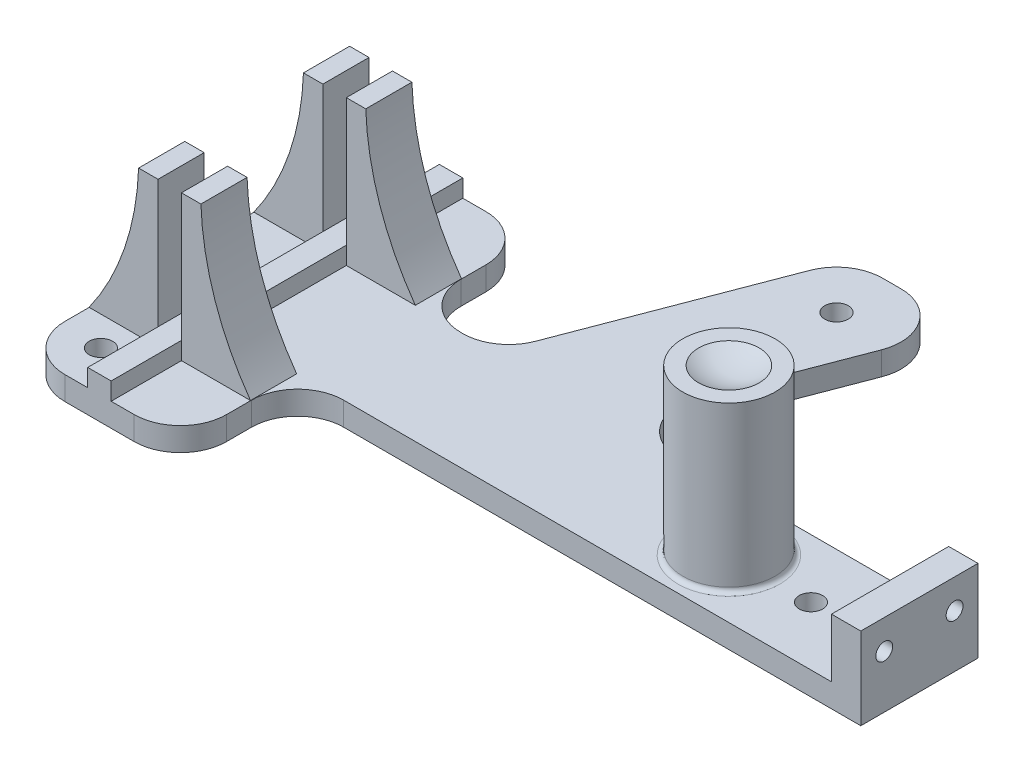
from build123d import *

# Parameters (mm, degrees)
BOSS_EXTRUDE1_DEPTH       = 5.08
BOSS_EXTRUDE2_DEPTH       = 10
SKETCH3_R                 = 10
BOSS_EXTRUDE3_DEPTH       = 35.56
FILLET1_R                 = 1
BOSS_EXTRUDE5_DEPTH       = 5.08
FILLET2_R                 = 10
FILLET3_R                 = 10
SKETCH9_W                 = 6.35
SKETCH9_H                 = 25.4
BOSS_EXTRUDE6_DEPTH       = 12.7
F_6_CLEARANCE_HOLE1_D     = 3.6576
F_6_CLEARANCE_HOLE1_DEPTH = 6.35
CUT_EXTRUDE1_REACH        = 156.709
SKETCH17_R                = 2.54
SKETCH18_W                = 9.525
SKETCH18_H                = 25.4
BOSS_EXTRUDE7_DEPTH       = 17.78
F_6_CLEARANCE_HOLE2_D     = 3.6576
F_6_CLEARANCE_HOLE2_DEPTH = 9.525
SKETCH21_W                = 9.525
SKETCH21_H                = 25.4
CUT_EXTRUDE2_DEPTH        = 12.7
SKETCH22_W                = 5.08
SKETCH22_H                = 76.2
BOSS_EXTRUDE8_DEPTH       = 3.81


with BuildPart() as part:
    # Sketch1 → Boss-Extrude1 (new body)
    with BuildSketch(Plane(origin=(0, 0, 0), x_dir=(1, 0, 0), z_dir=(0, 1, 0))):
        with BuildLine():
            Line((20.08, 28.1), (20.08, 22.7))
            ThreePointArc((20.08, 22.7), (23.008932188, 15.628932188), (30.08, 12.7))
            Line((30.08, 12.7), (126.24, 12.7))
            Line((126.24, 12.7), (132.59, 12.7))
            Line((132.59, 12.7), (132.59, 0))
            Line((132.59, 0), (132.59, -12.7))
            Line((132.59, -12.7), (126.24, -12.7))
            Line((126.24, -12.7), (30.08, -12.7))
            ThreePointArc((30.08, -12.7), (23.008932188, -15.628932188), (20.08, -22.7))
            Line((20.08, -22.7), (20.08, -28.1))
            ThreePointArc((20.08, -28.1), (17.151067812, -35.171067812), (10.08, -38.1))
            Line((10.08, -38.1), (-4.92, -38.1))
            ThreePointArc((-4.92, -38.1), (-11.991067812, -35.171067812), (-14.92, -28.1))
            Line((-14.92, -28.1), (-14.92, 28.1))
            ThreePointArc((-14.92, 28.1), (-11.991067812, 35.171067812), (-4.92, 38.1))
            Line((-4.92, 38.1), (10.08, 38.1))
            ThreePointArc((10.08, 38.1), (17.151067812, 35.171067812), (20.08, 28.1))
        make_face()
    extrude(amount=-BOSS_EXTRUDE1_DEPTH)

    # Sketch2 → Boss-Extrude2 (add)
    with BuildSketch(Plane.XY.offset(22.86)):
        with BuildLine():
            Line((0, 0), (-14.953299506, 0))
            ThreePointArc((-14.953299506, 0), (-7.255141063, 14.95657571), (-4.209502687, 31.5))
            Line((-4.209502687, 31.5), (0, 31.5))
            Line((0, 31.5), (0, 0))
        make_face()
        with BuildLine():
            Line((5.08, 0), (20.033299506, 0))
            ThreePointArc((20.033299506, 0), (12.335141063, 14.95657571), (9.289502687, 31.5))
            Line((9.289502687, 31.5), (5.08, 31.5))
            Line((5.08, 31.5), (5.08, 0))
        make_face()
    boss_extrude2 = extrude(amount=-BOSS_EXTRUDE2_DEPTH)

    # Mirror1: Boss-Extrude2 across plane
    add(boss_extrude2.mirror(Plane.XY))

    # Sketch3 → Boss-Extrude3 (add)
    with BuildSketch(Plane(origin=(0, 0, 0), x_dir=(1, 0, 0), z_dir=(0, 1, 0))):
        with Locations(Location((100.84, 0, 0), (0, 0, 90))):
            Circle(SKETCH3_R)
    extrude(amount=BOSS_EXTRUDE3_DEPTH)

    # Fillet1
    fillet1_edges = [part.edges().sort_by_distance(p)[0] for p in [
        (100.84, 0, 10),
    ]]
    fillet(fillet1_edges, radius=FILLET1_R)

    # Sketch4 → Cut-Revolve1 (revolve, cut)
    with BuildSketch(Plane.XY, mode=Mode.PRIVATE) as cut_revolve1_sk:
        with BuildLine():
            Line((100.84, 35.56), (107.399510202, 35.56))
            ThreePointArc((107.399510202, 35.56), (104.235709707, 34.2471456), (100.84, 33.797283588))
            Line((100.84, 33.797283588), (100.84, 35.56))
        make_face()
    revolve(cut_revolve1_sk.sketch.rotate(Axis((100.84, 35.56, 0), (0, -1, 0)), 90), axis=Axis((100.84, 35.56, 0), (0, -1, 0)), mode=Mode.SUBTRACT)

    # Sketch8 → Boss-Extrude5 (add)
    with BuildSketch(Plane(origin=(0, 0, 0), x_dir=(1, 0, 0), z_dir=(0, 1, 0))):
        with BuildLine():
            Line((37.34, 12.7), (56.207184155, 62.145063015))
            ThreePointArc((56.207184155, 62.145063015), (59.87783999, 66.815612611), (65.550113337, 68.58))
            Line((65.550113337, 68.58), (69.543550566, 68.58))
            ThreePointArc((69.543550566, 68.58), (77.779163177, 64.252273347), (78.886479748, 55.014936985))
            Line((78.886479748, 55.014936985), (62.74, 12.7))
            Line((62.74, 12.7), (37.34, 12.7))
        make_face()
    extrude(amount=-BOSS_EXTRUDE5_DEPTH)

    # Fillet2
    fillet2_edges = [part.edges().sort_by_distance(p)[0] for p in [
        (37.34, -2.54, -12.7),
    ]]
    fillet(fillet2_edges, radius=FILLET2_R)

    # Fillet3
    fillet3_edges = [part.edges().sort_by_distance(p)[0] for p in [
        (62.74, -2.54, -12.7),
    ]]
    fillet(fillet3_edges, radius=FILLET3_R)

    # Sketch9 → Boss-Extrude6 (add)
    with BuildSketch(Plane(origin=(0, 0, 0), x_dir=(1, 0, 0), z_dir=(0, 1, 0))):
        with Locations((129.415, 0)):
            Rectangle(SKETCH9_W, SKETCH9_H)
    extrude(amount=BOSS_EXTRUDE6_DEPTH)

    # 6 Clearance Hole1
    with Locations(Plane(origin=(132.59, 0, 0), x_dir=(0, 0, -1), z_dir=(1, 0, 0))):
        with Locations((7.62, 6.35), (-7.62, 6.35)):
            Hole(F_6_CLEARANCE_HOLE1_D / 2, depth=F_6_CLEARANCE_HOLE1_DEPTH)

    # Sketch17 → Cut-Extrude1 (cut, up to next)
    with BuildSketch(Plane.XZ.offset(5.08), mode=Mode.PRIVATE) as cut_extrude1_sk1:
        with Locations(Location((-6.03, 29.21, 0), (0, 0, 270))):
            Circle(SKETCH17_R)
    cut_extrude1_tool1 = extrude(cut_extrude1_sk1.sketch, amount=-CUT_EXTRUDE1_REACH, mode=Mode.PRIVATE) & part.part
    # Sketch17 → Cut-Extrude1 (cut, up to next)
    with BuildSketch(Plane.XZ.offset(5.08), mode=Mode.PRIVATE) as cut_extrude1_sk2:
        with Locations(Location((-6.03, -29.21, 0), (0, 0, 90))):
            Circle(SKETCH17_R)
    cut_extrude1_tool2 = extrude(cut_extrude1_sk2.sketch, amount=-CUT_EXTRUDE1_REACH, mode=Mode.PRIVATE) & part.part
    # Sketch17 → Cut-Extrude1 (cut, up to next)
    with BuildSketch(Plane.XZ.offset(5.08), mode=Mode.PRIVATE) as cut_extrude1_sk3:
        with Locations(Location((67.001174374, -57.15, 0), (0, 0, 270))):
            Circle(SKETCH17_R)
    cut_extrude1_tool3 = extrude(cut_extrude1_sk3.sketch, amount=-CUT_EXTRUDE1_REACH, mode=Mode.PRIVATE) & part.part
    # Sketch17 → Cut-Extrude1 (cut, up to next)
    with BuildSketch(Plane.XZ.offset(5.08), mode=Mode.PRIVATE) as cut_extrude1_sk4:
        with Locations(Location((118.62, 0, 0), (0, 0, 270))):
            Circle(SKETCH17_R)
    cut_extrude1_tool4 = extrude(cut_extrude1_sk4.sketch, amount=-CUT_EXTRUDE1_REACH, mode=Mode.PRIVATE) & part.part
    add(cut_extrude1_tool1.solids().sort_by_distance((-6.03, -5.08, 29.21))[0], mode=Mode.SUBTRACT)
    add(cut_extrude1_tool2.solids().sort_by_distance((-6.03, -5.08, -29.21))[0], mode=Mode.SUBTRACT)
    add(cut_extrude1_tool3.solids().sort_by_distance((67.001174, -5.08, -57.15))[0], mode=Mode.SUBTRACT)
    add(cut_extrude1_tool4.solids().sort_by_distance((118.62, -5.08, 0))[0], mode=Mode.SUBTRACT)

    # Sketch18 → Boss-Extrude7 (add)
    with BuildSketch(Plane(origin=(0, 12.7, 0), x_dir=(1, 0, 0), z_dir=(0, 1, 0))):
        with Locations((137.3525, 0)):
            Rectangle(SKETCH18_W, SKETCH18_H)
    extrude(amount=-BOSS_EXTRUDE7_DEPTH)

    # 6 Clearance Hole2
    with Locations(Plane.ZY.offset(-132.59)):
        with Locations((7.62, 6.35), (-7.62, 6.35)):
            Hole(F_6_CLEARANCE_HOLE2_D / 2, depth=F_6_CLEARANCE_HOLE2_DEPTH)

    # Sketch21 → Cut-Extrude2 (cut)
    with BuildSketch(Plane(origin=(0, 12.7, 0), x_dir=(1, 0, 0), z_dir=(0, 1, 0))):
        with Locations((131.0025, 0)):
            Rectangle(SKETCH21_W, SKETCH21_H)
    extrude(amount=-CUT_EXTRUDE2_DEPTH, mode=Mode.SUBTRACT)

    # Sketch22 → Boss-Extrude8 (add)
    with BuildSketch(Plane(origin=(0, 0, 0), x_dir=(1, 0, 0), z_dir=(0, 1, 0))):
        with Locations((2.54, 0)):
            Rectangle(SKETCH22_W, SKETCH22_H)
    extrude(amount=BOSS_EXTRUDE8_DEPTH)


solid = part.part
